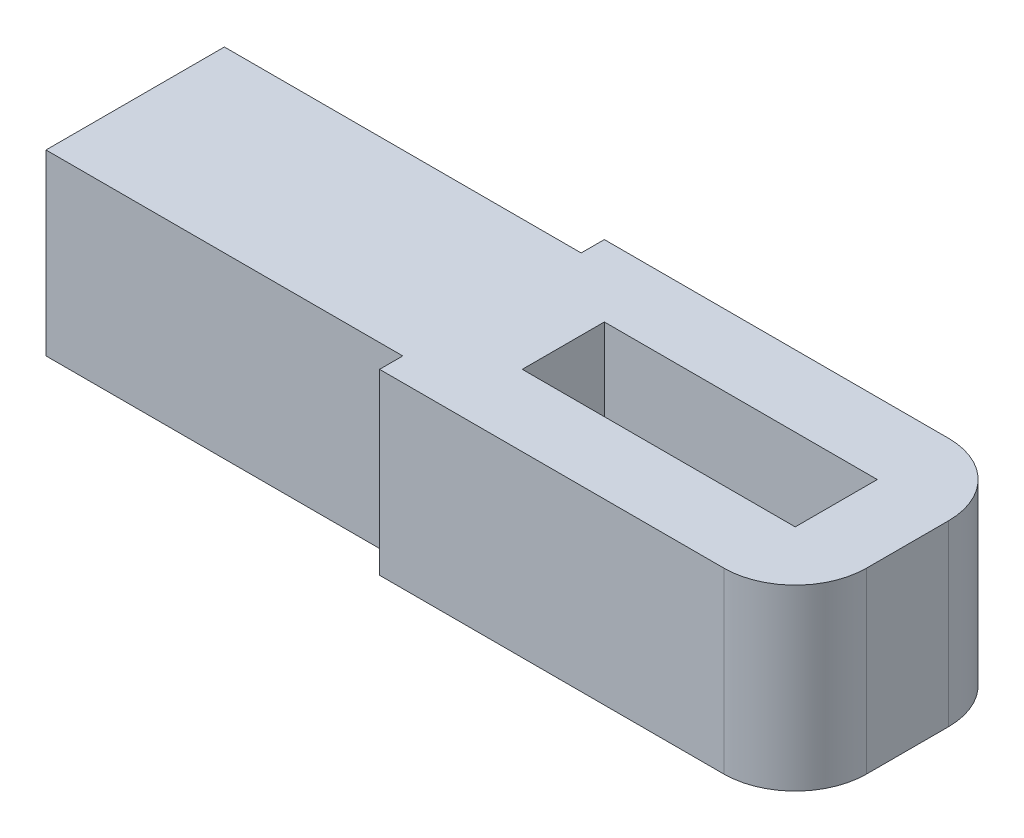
ISO-10303-21;
HEADER;
FILE_DESCRIPTION(('STEP AP214'),'2;1');
FILE_NAME('part.step','',(''),(''),'','','');
FILE_SCHEMA(('AUTOMOTIVE_DESIGN { 1 0 10303 214 1 1 1 1 }'));
ENDSEC;
DATA;
#1=APPLICATION_CONTEXT('core data for automotive mechanical design processes');
#2=APPLICATION_PROTOCOL_DEFINITION('international standard','automotive_design',2000,#1);
#3=PRODUCT_CONTEXT('',#1,'mechanical');
#4=PRODUCT('Part','Part','',(#3));
#5=PRODUCT_RELATED_PRODUCT_CATEGORY('part','',(#4));
#6=PRODUCT_DEFINITION_FORMATION('','',#4);
#7=PRODUCT_DEFINITION_CONTEXT('part definition',#1,'design');
#8=PRODUCT_DEFINITION('design','',#6,#7);
#9=PRODUCT_DEFINITION_SHAPE('','',#8);
#10=(LENGTH_UNIT() NAMED_UNIT(*) SI_UNIT(.MILLI.,.METRE.));
#11=(NAMED_UNIT(*) PLANE_ANGLE_UNIT() SI_UNIT($,.RADIAN.));
#12=(NAMED_UNIT(*) SI_UNIT($,.STERADIAN.) SOLID_ANGLE_UNIT());
#13=UNCERTAINTY_MEASURE_WITH_UNIT(LENGTH_MEASURE(1.E-05),#10,'distance_accuracy_value','');
#14=(GEOMETRIC_REPRESENTATION_CONTEXT(3) GLOBAL_UNCERTAINTY_ASSIGNED_CONTEXT((#13)) GLOBAL_UNIT_ASSIGNED_CONTEXT((#10,
#11,#12)) REPRESENTATION_CONTEXT('',''));
#15=CARTESIAN_POINT('',(0.,0.,0.));
#16=DIRECTION('',(0.,0.,1.));
#17=DIRECTION('',(1.,0.,0.));
#18=AXIS2_PLACEMENT_3D('',#15,#16,#17);
#19=CARTESIAN_POINT('',(-5.825,5.,-3.15));
#20=DIRECTION('',(1.,0.,0.));
#21=DIRECTION('',(0.,0.,-1.));
#22=AXIS2_PLACEMENT_3D('',#19,#20,#21);
#23=PLANE('',#22);
#24=DIRECTION('',(0.,1.,0.));
#25=VECTOR('',#24,1.);
#26=CARTESIAN_POINT('',(-5.825,-11.1803398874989,2.5));
#27=LINE('',#26,#25);
#28=CARTESIAN_POINT('',(-5.825,0.,2.5));
#29=VERTEX_POINT('',#28);
#30=CARTESIAN_POINT('',(-5.825,5.,2.5));
#31=VERTEX_POINT('',#30);
#32=EDGE_CURVE('E57',#29,#31,#27,.T.);
#33=ORIENTED_EDGE('',*,*,#32,.F.);
#34=DIRECTION('',(0.,0.,1.));
#35=VECTOR('',#34,1.);
#36=CARTESIAN_POINT('',(-5.825,0.,-3.15));
#37=LINE('',#36,#35);
#38=CARTESIAN_POINT('',(-5.825,0.,3.15));
#39=VERTEX_POINT('',#38);
#40=EDGE_CURVE('E219',#29,#39,#37,.T.);
#41=ORIENTED_EDGE('',*,*,#40,.T.);
#42=DIRECTION('',(0.,-1.,0.));
#43=VECTOR('',#42,1.);
#44=CARTESIAN_POINT('',(-5.825,5.,3.15));
#45=LINE('',#44,#43);
#46=CARTESIAN_POINT('',(-5.825,5.,3.15));
#47=VERTEX_POINT('',#46);
#48=EDGE_CURVE('E214',#47,#39,#45,.T.);
#49=ORIENTED_EDGE('',*,*,#48,.F.);
#50=DIRECTION('',(0.,0.,1.));
#51=VECTOR('',#50,1.);
#52=CARTESIAN_POINT('',(-5.825,5.,-3.15));
#53=LINE('',#52,#51);
#54=EDGE_CURVE('E210',#31,#47,#53,.T.);
#55=ORIENTED_EDGE('',*,*,#54,.F.);
#56=EDGE_LOOP('',(#33,#41,#49,#55));
#57=FACE_BOUND('',#56,.T.);
#58=ADVANCED_FACE('F34',(#57),#23,.F.);
#59=CARTESIAN_POINT('',(0.,5.,0.));
#60=DIRECTION('',(0.,1.,0.));
#61=DIRECTION('',(0.,0.,1.));
#62=AXIS2_PLACEMENT_3D('',#59,#60,#61);
#63=PLANE('',#62);
#64=DIRECTION('',(1.,0.,0.));
#65=VECTOR('',#64,1.);
#66=CARTESIAN_POINT('',(-5.825,5.,3.15));
#67=LINE('',#66,#65);
#68=CARTESIAN_POINT('',(3.825,5.,3.15));
#69=VERTEX_POINT('',#68);
#70=EDGE_CURVE('E212',#47,#69,#67,.T.);
#71=ORIENTED_EDGE('',*,*,#70,.T.);
#72=CARTESIAN_POINT('',(3.825,5.,1.15));
#73=DIRECTION('',(0.,1.,0.));
#74=DIRECTION('',(0.,0.,1.));
#75=AXIS2_PLACEMENT_3D('',#72,#73,#74);
#76=CIRCLE('',#75,2.);
#77=CARTESIAN_POINT('',(5.825,5.,1.15));
#78=VERTEX_POINT('',#77);
#79=EDGE_CURVE('E42',#69,#78,#76,.T.);
#80=ORIENTED_EDGE('',*,*,#79,.T.);
#81=DIRECTION('',(0.,0.,-1.));
#82=VECTOR('',#81,1.);
#83=CARTESIAN_POINT('',(5.825,5.,-3.15));
#84=LINE('',#83,#82);
#85=CARTESIAN_POINT('',(5.825,5.,-1.15));
#86=VERTEX_POINT('',#85);
#87=EDGE_CURVE('E204',#78,#86,#84,.T.);
#88=ORIENTED_EDGE('',*,*,#87,.T.);
#89=CARTESIAN_POINT('',(3.825,5.,-1.15));
#90=DIRECTION('',(0.,1.,0.));
#91=DIRECTION('',(0.,0.,1.));
#92=AXIS2_PLACEMENT_3D('',#89,#90,#91);
#93=CIRCLE('',#92,2.);
#94=CARTESIAN_POINT('',(3.825,5.,-3.15));
#95=VERTEX_POINT('',#94);
#96=EDGE_CURVE('E240',#86,#95,#93,.T.);
#97=ORIENTED_EDGE('',*,*,#96,.T.);
#98=DIRECTION('',(-1.,0.,0.));
#99=VECTOR('',#98,1.);
#100=CARTESIAN_POINT('',(-5.825,5.,-3.15));
#101=LINE('',#100,#99);
#102=CARTESIAN_POINT('',(-5.825,5.,-3.15));
#103=VERTEX_POINT('',#102);
#104=EDGE_CURVE('E207',#95,#103,#101,.T.);
#105=ORIENTED_EDGE('',*,*,#104,.T.);
#106=CARTESIAN_POINT('',(-5.825,5.,-2.5));
#107=VERTEX_POINT('',#106);
#108=EDGE_CURVE('E160',#103,#107,#53,.T.);
#109=ORIENTED_EDGE('',*,*,#108,.T.);
#110=DIRECTION('',(-1.,0.,0.));
#111=VECTOR('',#110,1.);
#112=CARTESIAN_POINT('',(-5.825,5.,-2.5));
#113=LINE('',#112,#111);
#114=CARTESIAN_POINT('',(-15.825,5.,-2.5));
#115=VERTEX_POINT('',#114);
#116=EDGE_CURVE('E141',#107,#115,#113,.T.);
#117=ORIENTED_EDGE('',*,*,#116,.T.);
#118=DIRECTION('',(0.,0.,1.));
#119=VECTOR('',#118,1.);
#120=CARTESIAN_POINT('',(-15.825,5.,-2.5));
#121=LINE('',#120,#119);
#122=CARTESIAN_POINT('',(-15.825,5.,2.5));
#123=VERTEX_POINT('',#122);
#124=EDGE_CURVE('E149',#115,#123,#121,.T.);
#125=ORIENTED_EDGE('',*,*,#124,.T.);
#126=DIRECTION('',(1.,0.,0.));
#127=VECTOR('',#126,1.);
#128=CARTESIAN_POINT('',(-5.825,5.,2.5));
#129=LINE('',#128,#127);
#130=EDGE_CURVE('E155',#123,#31,#129,.T.);
#131=ORIENTED_EDGE('',*,*,#130,.T.);
#132=ORIENTED_EDGE('',*,*,#54,.T.);
#133=EDGE_LOOP('',(#71,#80,#88,#97,#105,#109,#117,#125,#131,#132));
#134=FACE_BOUND('',#133,.T.);
#135=DIRECTION('',(-1.,0.,0.));
#136=VECTOR('',#135,1.);
#137=CARTESIAN_POINT('',(-3.825,5.,-1.15));
#138=LINE('',#137,#136);
#139=CARTESIAN_POINT('',(3.825,5.,-1.15));
#140=VERTEX_POINT('',#139);
#141=CARTESIAN_POINT('',(-3.825,5.,-1.15));
#142=VERTEX_POINT('',#141);
#143=EDGE_CURVE('E175',#140,#142,#138,.T.);
#144=ORIENTED_EDGE('',*,*,#143,.F.);
#145=DIRECTION('',(0.,0.,-1.));
#146=VECTOR('',#145,1.);
#147=CARTESIAN_POINT('',(3.825,5.,-1.15));
#148=LINE('',#147,#146);
#149=CARTESIAN_POINT('',(3.825,5.,1.15));
#150=VERTEX_POINT('',#149);
#151=EDGE_CURVE('E173',#150,#140,#148,.T.);
#152=ORIENTED_EDGE('',*,*,#151,.F.);
#153=DIRECTION('',(1.,0.,0.));
#154=VECTOR('',#153,1.);
#155=CARTESIAN_POINT('',(-3.825,5.,1.15));
#156=LINE('',#155,#154);
#157=CARTESIAN_POINT('',(-3.825,5.,1.15));
#158=VERTEX_POINT('',#157);
#159=EDGE_CURVE('E181',#158,#150,#156,.T.);
#160=ORIENTED_EDGE('',*,*,#159,.F.);
#161=DIRECTION('',(0.,0.,1.));
#162=VECTOR('',#161,1.);
#163=CARTESIAN_POINT('',(-3.825,5.,-1.15));
#164=LINE('',#163,#162);
#165=EDGE_CURVE('E178',#142,#158,#164,.T.);
#166=ORIENTED_EDGE('',*,*,#165,.F.);
#167=EDGE_LOOP('',(#144,#152,#160,#166));
#168=FACE_BOUND('',#167,.T.);
#169=ADVANCED_FACE('F158',(#134,#168),#63,.T.);
#170=CARTESIAN_POINT('',(0.,0.,0.));
#171=DIRECTION('',(0.,1.,0.));
#172=DIRECTION('',(0.,0.,1.));
#173=AXIS2_PLACEMENT_3D('',#170,#171,#172);
#174=PLANE('',#173);
#175=DIRECTION('',(0.,0.,-1.));
#176=VECTOR('',#175,1.);
#177=CARTESIAN_POINT('',(5.825,0.,-3.15));
#178=LINE('',#177,#176);
#179=CARTESIAN_POINT('',(5.825,0.,1.15));
#180=VERTEX_POINT('',#179);
#181=CARTESIAN_POINT('',(5.825,0.,-1.15));
#182=VERTEX_POINT('',#181);
#183=EDGE_CURVE('E203',#180,#182,#178,.T.);
#184=ORIENTED_EDGE('',*,*,#183,.F.);
#185=CARTESIAN_POINT('',(3.825,0.,1.15));
#186=DIRECTION('',(0.,1.,0.));
#187=DIRECTION('',(0.,0.,1.));
#188=AXIS2_PLACEMENT_3D('',#185,#186,#187);
#189=CIRCLE('',#188,2.);
#190=CARTESIAN_POINT('',(3.825,0.,3.15));
#191=VERTEX_POINT('',#190);
#192=EDGE_CURVE('E236',#180,#191,#189,.F.);
#193=ORIENTED_EDGE('',*,*,#192,.T.);
#194=DIRECTION('',(1.,0.,0.));
#195=VECTOR('',#194,1.);
#196=CARTESIAN_POINT('',(-5.825,0.,3.15));
#197=LINE('',#196,#195);
#198=EDGE_CURVE('E208',#39,#191,#197,.T.);
#199=ORIENTED_EDGE('',*,*,#198,.F.);
#200=ORIENTED_EDGE('',*,*,#40,.F.);
#201=DIRECTION('',(-1.,0.,0.));
#202=VECTOR('',#201,1.);
#203=CARTESIAN_POINT('',(-5.825,0.,2.5));
#204=LINE('',#203,#202);
#205=CARTESIAN_POINT('',(-15.825,0.,2.5));
#206=VERTEX_POINT('',#205);
#207=EDGE_CURVE('E163',#29,#206,#204,.T.);
#208=ORIENTED_EDGE('',*,*,#207,.T.);
#209=DIRECTION('',(0.,0.,-1.));
#210=VECTOR('',#209,1.);
#211=CARTESIAN_POINT('',(-15.825,0.,-2.5));
#212=LINE('',#211,#210);
#213=CARTESIAN_POINT('',(-15.825,0.,-2.5));
#214=VERTEX_POINT('',#213);
#215=EDGE_CURVE('E168',#206,#214,#212,.T.);
#216=ORIENTED_EDGE('',*,*,#215,.T.);
#217=DIRECTION('',(1.,0.,0.));
#218=VECTOR('',#217,1.);
#219=CARTESIAN_POINT('',(-5.825,0.,-2.5));
#220=LINE('',#219,#218);
#221=CARTESIAN_POINT('',(-5.825,0.,-2.5));
#222=VERTEX_POINT('',#221);
#223=EDGE_CURVE('E143',#214,#222,#220,.T.);
#224=ORIENTED_EDGE('',*,*,#223,.T.);
#225=CARTESIAN_POINT('',(-5.825,0.,-3.15));
#226=VERTEX_POINT('',#225);
#227=EDGE_CURVE('E220',#226,#222,#37,.T.);
#228=ORIENTED_EDGE('',*,*,#227,.F.);
#229=DIRECTION('',(-1.,0.,0.));
#230=VECTOR('',#229,1.);
#231=CARTESIAN_POINT('',(-5.825,0.,-3.15));
#232=LINE('',#231,#230);
#233=CARTESIAN_POINT('',(3.825,0.,-3.15));
#234=VERTEX_POINT('',#233);
#235=EDGE_CURVE('E217',#234,#226,#232,.T.);
#236=ORIENTED_EDGE('',*,*,#235,.F.);
#237=CARTESIAN_POINT('',(3.825,0.,-1.15));
#238=DIRECTION('',(0.,1.,0.));
#239=DIRECTION('',(0.,0.,1.));
#240=AXIS2_PLACEMENT_3D('',#237,#238,#239);
#241=CIRCLE('',#240,2.);
#242=EDGE_CURVE('E234',#234,#182,#241,.F.);
#243=ORIENTED_EDGE('',*,*,#242,.T.);
#244=EDGE_LOOP('',(#184,#193,#199,#200,#208,#216,#224,#228,#236,#243));
#245=FACE_BOUND('',#244,.T.);
#246=DIRECTION('',(0.,0.,-1.));
#247=VECTOR('',#246,1.);
#248=CARTESIAN_POINT('',(3.825,0.,-1.15));
#249=LINE('',#248,#247);
#250=CARTESIAN_POINT('',(3.825,0.,1.15));
#251=VERTEX_POINT('',#250);
#252=CARTESIAN_POINT('',(3.825,0.,-1.15));
#253=VERTEX_POINT('',#252);
#254=EDGE_CURVE('E172',#251,#253,#249,.T.);
#255=ORIENTED_EDGE('',*,*,#254,.T.);
#256=DIRECTION('',(-1.,0.,0.));
#257=VECTOR('',#256,1.);
#258=CARTESIAN_POINT('',(-3.825,0.,-1.15));
#259=LINE('',#258,#257);
#260=CARTESIAN_POINT('',(-3.825,0.,-1.15));
#261=VERTEX_POINT('',#260);
#262=EDGE_CURVE('E186',#253,#261,#259,.T.);
#263=ORIENTED_EDGE('',*,*,#262,.T.);
#264=DIRECTION('',(0.,0.,1.));
#265=VECTOR('',#264,1.);
#266=CARTESIAN_POINT('',(-3.825,0.,-1.15));
#267=LINE('',#266,#265);
#268=CARTESIAN_POINT('',(-3.825,0.,1.15));
#269=VERTEX_POINT('',#268);
#270=EDGE_CURVE('E189',#261,#269,#267,.T.);
#271=ORIENTED_EDGE('',*,*,#270,.T.);
#272=DIRECTION('',(1.,0.,0.));
#273=VECTOR('',#272,1.);
#274=CARTESIAN_POINT('',(-3.825,0.,1.15));
#275=LINE('',#274,#273);
#276=EDGE_CURVE('E176',#269,#251,#275,.T.);
#277=ORIENTED_EDGE('',*,*,#276,.T.);
#278=EDGE_LOOP('',(#255,#263,#271,#277));
#279=FACE_BOUND('',#278,.T.);
#280=ADVANCED_FACE('F255',(#245,#279),#174,.F.);
#281=CARTESIAN_POINT('',(5.825,5.,-3.15));
#282=DIRECTION('',(-1.,0.,0.));
#283=DIRECTION('',(0.,0.,1.));
#284=AXIS2_PLACEMENT_3D('',#281,#282,#283);
#285=PLANE('',#284);
#286=ORIENTED_EDGE('',*,*,#87,.F.);
#287=DIRECTION('',(0.,-1.,0.));
#288=VECTOR('',#287,1.);
#289=CARTESIAN_POINT('',(5.825,5.,1.15));
#290=LINE('',#289,#288);
#291=EDGE_CURVE('E231',#78,#180,#290,.T.);
#292=ORIENTED_EDGE('',*,*,#291,.T.);
#293=ORIENTED_EDGE('',*,*,#183,.T.);
#294=DIRECTION('',(0.,-1.,0.));
#295=VECTOR('',#294,1.);
#296=CARTESIAN_POINT('',(5.825,5.,-1.15));
#297=LINE('',#296,#295);
#298=EDGE_CURVE('E229',#182,#86,#297,.F.);
#299=ORIENTED_EDGE('',*,*,#298,.T.);
#300=EDGE_LOOP('',(#286,#292,#293,#299));
#301=FACE_BOUND('',#300,.T.);
#302=ADVANCED_FACE('F249',(#301),#285,.F.);
#303=CARTESIAN_POINT('',(-5.825,5.,-3.15));
#304=DIRECTION('',(0.,0.,1.));
#305=DIRECTION('',(1.,0.,0.));
#306=AXIS2_PLACEMENT_3D('',#303,#304,#305);
#307=PLANE('',#306);
#308=ORIENTED_EDGE('',*,*,#104,.F.);
#309=DIRECTION('',(0.,-1.,0.));
#310=VECTOR('',#309,1.);
#311=CARTESIAN_POINT('',(3.825,5.,-3.15));
#312=LINE('',#311,#310);
#313=EDGE_CURVE('E11',#95,#234,#312,.T.);
#314=ORIENTED_EDGE('',*,*,#313,.T.);
#315=ORIENTED_EDGE('',*,*,#235,.T.);
#316=DIRECTION('',(0.,-1.,0.));
#317=VECTOR('',#316,1.);
#318=CARTESIAN_POINT('',(-5.825,5.,-3.15));
#319=LINE('',#318,#317);
#320=EDGE_CURVE('E226',#103,#226,#319,.T.);
#321=ORIENTED_EDGE('',*,*,#320,.F.);
#322=EDGE_LOOP('',(#308,#314,#315,#321));
#323=FACE_BOUND('',#322,.T.);
#324=ADVANCED_FACE('F269',(#323),#307,.F.);
#325=ORIENTED_EDGE('',*,*,#227,.T.);
#326=DIRECTION('',(0.,1.,0.));
#327=VECTOR('',#326,1.);
#328=CARTESIAN_POINT('',(-5.825,-11.1803398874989,-2.5));
#329=LINE('',#328,#327);
#330=EDGE_CURVE('E49',#222,#107,#329,.T.);
#331=ORIENTED_EDGE('',*,*,#330,.T.);
#332=ORIENTED_EDGE('',*,*,#108,.F.);
#333=ORIENTED_EDGE('',*,*,#320,.T.);
#334=EDGE_LOOP('',(#325,#331,#332,#333));
#335=FACE_BOUND('',#334,.T.);
#336=ADVANCED_FACE('F265',(#335),#23,.F.);
#337=CARTESIAN_POINT('',(-5.825,5.,3.15));
#338=DIRECTION('',(0.,0.,-1.));
#339=DIRECTION('',(-1.,0.,0.));
#340=AXIS2_PLACEMENT_3D('',#337,#338,#339);
#341=PLANE('',#340);
#342=ORIENTED_EDGE('',*,*,#198,.T.);
#343=DIRECTION('',(0.,-1.,0.));
#344=VECTOR('',#343,1.);
#345=CARTESIAN_POINT('',(3.825,5.,3.15));
#346=LINE('',#345,#344);
#347=EDGE_CURVE('E238',#191,#69,#346,.F.);
#348=ORIENTED_EDGE('',*,*,#347,.T.);
#349=ORIENTED_EDGE('',*,*,#70,.F.);
#350=ORIENTED_EDGE('',*,*,#48,.T.);
#351=EDGE_LOOP('',(#342,#348,#349,#350));
#352=FACE_BOUND('',#351,.T.);
#353=ADVANCED_FACE('F258',(#352),#341,.F.);
#354=CARTESIAN_POINT('',(3.825,5.,-1.15));
#355=DIRECTION('',(-1.,0.,0.));
#356=DIRECTION('',(0.,0.,1.));
#357=AXIS2_PLACEMENT_3D('',#354,#355,#356);
#358=PLANE('',#357);
#359=ORIENTED_EDGE('',*,*,#254,.F.);
#360=DIRECTION('',(0.,-1.,0.));
#361=VECTOR('',#360,1.);
#362=CARTESIAN_POINT('',(3.825,5.,1.15));
#363=LINE('',#362,#361);
#364=EDGE_CURVE('E183',#150,#251,#363,.T.);
#365=ORIENTED_EDGE('',*,*,#364,.F.);
#366=ORIENTED_EDGE('',*,*,#151,.T.);
#367=DIRECTION('',(0.,-1.,0.));
#368=VECTOR('',#367,1.);
#369=CARTESIAN_POINT('',(3.825,5.,-1.15));
#370=LINE('',#369,#368);
#371=EDGE_CURVE('E200',#140,#253,#370,.T.);
#372=ORIENTED_EDGE('',*,*,#371,.T.);
#373=EDGE_LOOP('',(#359,#365,#366,#372));
#374=FACE_BOUND('',#373,.T.);
#375=ADVANCED_FACE('F292',(#374),#358,.T.);
#376=CARTESIAN_POINT('',(-3.825,5.,-1.15));
#377=DIRECTION('',(0.,0.,1.));
#378=DIRECTION('',(1.,0.,0.));
#379=AXIS2_PLACEMENT_3D('',#376,#377,#378);
#380=PLANE('',#379);
#381=ORIENTED_EDGE('',*,*,#262,.F.);
#382=ORIENTED_EDGE('',*,*,#371,.F.);
#383=ORIENTED_EDGE('',*,*,#143,.T.);
#384=DIRECTION('',(0.,-1.,0.));
#385=VECTOR('',#384,1.);
#386=CARTESIAN_POINT('',(-3.825,5.,-1.15));
#387=LINE('',#386,#385);
#388=EDGE_CURVE('E198',#142,#261,#387,.T.);
#389=ORIENTED_EDGE('',*,*,#388,.T.);
#390=EDGE_LOOP('',(#381,#382,#383,#389));
#391=FACE_BOUND('',#390,.T.);
#392=ADVANCED_FACE('F306',(#391),#380,.T.);
#393=CARTESIAN_POINT('',(-3.825,5.,-1.15));
#394=DIRECTION('',(1.,0.,0.));
#395=DIRECTION('',(0.,0.,-1.));
#396=AXIS2_PLACEMENT_3D('',#393,#394,#395);
#397=PLANE('',#396);
#398=ORIENTED_EDGE('',*,*,#270,.F.);
#399=ORIENTED_EDGE('',*,*,#388,.F.);
#400=ORIENTED_EDGE('',*,*,#165,.T.);
#401=DIRECTION('',(0.,-1.,0.));
#402=VECTOR('',#401,1.);
#403=CARTESIAN_POINT('',(-3.825,5.,1.15));
#404=LINE('',#403,#402);
#405=EDGE_CURVE('E196',#158,#269,#404,.T.);
#406=ORIENTED_EDGE('',*,*,#405,.T.);
#407=EDGE_LOOP('',(#398,#399,#400,#406));
#408=FACE_BOUND('',#407,.T.);
#409=ADVANCED_FACE('F310',(#408),#397,.T.);
#410=CARTESIAN_POINT('',(-3.825,5.,1.15));
#411=DIRECTION('',(0.,0.,-1.));
#412=DIRECTION('',(-1.,0.,0.));
#413=AXIS2_PLACEMENT_3D('',#410,#411,#412);
#414=PLANE('',#413);
#415=ORIENTED_EDGE('',*,*,#276,.F.);
#416=ORIENTED_EDGE('',*,*,#405,.F.);
#417=ORIENTED_EDGE('',*,*,#159,.T.);
#418=ORIENTED_EDGE('',*,*,#364,.T.);
#419=EDGE_LOOP('',(#415,#416,#417,#418));
#420=FACE_BOUND('',#419,.T.);
#421=ADVANCED_FACE('F278',(#420),#414,.T.);
#422=CARTESIAN_POINT('',(3.825,5.,1.15));
#423=DIRECTION('',(0.,-1.,0.));
#424=DIRECTION('',(0.,0.,-1.));
#425=AXIS2_PLACEMENT_3D('',#422,#423,#424);
#426=CYLINDRICAL_SURFACE('',#425,2.);
#427=ORIENTED_EDGE('',*,*,#79,.F.);
#428=ORIENTED_EDGE('',*,*,#347,.F.);
#429=ORIENTED_EDGE('',*,*,#192,.F.);
#430=ORIENTED_EDGE('',*,*,#291,.F.);
#431=EDGE_LOOP('',(#427,#428,#429,#430));
#432=FACE_BOUND('',#431,.T.);
#433=ADVANCED_FACE('F252',(#432),#426,.T.);
#434=CARTESIAN_POINT('',(3.825,5.,-1.15));
#435=DIRECTION('',(0.,-1.,0.));
#436=DIRECTION('',(0.,0.,-1.));
#437=AXIS2_PLACEMENT_3D('',#434,#435,#436);
#438=CYLINDRICAL_SURFACE('',#437,2.);
#439=ORIENTED_EDGE('',*,*,#96,.F.);
#440=ORIENTED_EDGE('',*,*,#298,.F.);
#441=ORIENTED_EDGE('',*,*,#242,.F.);
#442=ORIENTED_EDGE('',*,*,#313,.F.);
#443=EDGE_LOOP('',(#439,#440,#441,#442));
#444=FACE_BOUND('',#443,.T.);
#445=ADVANCED_FACE('F36',(#444),#438,.T.);
#446=CARTESIAN_POINT('',(-5.825,-11.1803398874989,2.5));
#447=DIRECTION('',(0.,0.,1.));
#448=DIRECTION('',(1.,0.,0.));
#449=AXIS2_PLACEMENT_3D('',#446,#447,#448);
#450=PLANE('',#449);
#451=ORIENTED_EDGE('',*,*,#207,.F.);
#452=ORIENTED_EDGE('',*,*,#32,.T.);
#453=ORIENTED_EDGE('',*,*,#130,.F.);
#454=DIRECTION('',(0.,1.,0.));
#455=VECTOR('',#454,1.);
#456=CARTESIAN_POINT('',(-15.825,-11.1803398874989,2.5));
#457=LINE('',#456,#455);
#458=EDGE_CURVE('E146',#206,#123,#457,.T.);
#459=ORIENTED_EDGE('',*,*,#458,.F.);
#460=EDGE_LOOP('',(#451,#452,#453,#459));
#461=FACE_BOUND('',#460,.T.);
#462=ADVANCED_FACE('F262',(#461),#450,.T.);
#463=CARTESIAN_POINT('',(-15.825,-11.1803398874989,-2.5));
#464=DIRECTION('',(-1.,0.,0.));
#465=DIRECTION('',(0.,0.,1.));
#466=AXIS2_PLACEMENT_3D('',#463,#464,#465);
#467=PLANE('',#466);
#468=ORIENTED_EDGE('',*,*,#215,.F.);
#469=ORIENTED_EDGE('',*,*,#458,.T.);
#470=ORIENTED_EDGE('',*,*,#124,.F.);
#471=DIRECTION('',(0.,1.,0.));
#472=VECTOR('',#471,1.);
#473=CARTESIAN_POINT('',(-15.825,-11.1803398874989,-2.5));
#474=LINE('',#473,#472);
#475=EDGE_CURVE('E137',#214,#115,#474,.T.);
#476=ORIENTED_EDGE('',*,*,#475,.F.);
#477=EDGE_LOOP('',(#468,#469,#470,#476));
#478=FACE_BOUND('',#477,.T.);
#479=ADVANCED_FACE('F150',(#478),#467,.T.);
#480=CARTESIAN_POINT('',(-5.825,-11.1803398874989,-2.5));
#481=DIRECTION('',(0.,0.,-1.));
#482=DIRECTION('',(-1.,0.,0.));
#483=AXIS2_PLACEMENT_3D('',#480,#481,#482);
#484=PLANE('',#483);
#485=ORIENTED_EDGE('',*,*,#223,.F.);
#486=ORIENTED_EDGE('',*,*,#475,.T.);
#487=ORIENTED_EDGE('',*,*,#116,.F.);
#488=ORIENTED_EDGE('',*,*,#330,.F.);
#489=EDGE_LOOP('',(#485,#486,#487,#488));
#490=FACE_BOUND('',#489,.T.);
#491=ADVANCED_FACE('F139',(#490),#484,.T.);
#492=CLOSED_SHELL('',(#58,#169,#280,#302,#324,#336,#353,#375,#392,#409,#421,#433,#445,#462,#479,#491));
#493=MANIFOLD_SOLID_BREP('B2',#492);
#494=ADVANCED_BREP_SHAPE_REPRESENTATION('',(#18,#493),#14);
#495=SHAPE_DEFINITION_REPRESENTATION(#9,#494);
ENDSEC;
END-ISO-10303-21;
